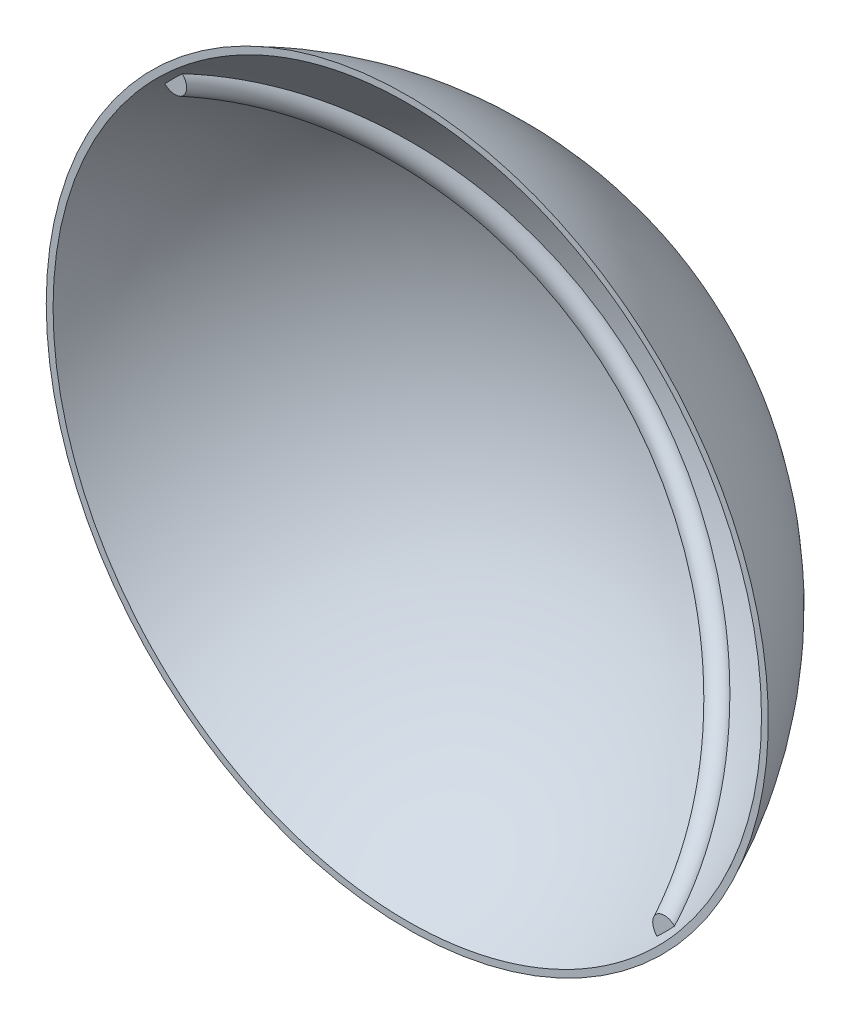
ISO-10303-21;
HEADER;
FILE_DESCRIPTION(('STEP AP214'),'2;1');
FILE_NAME('part.step','',(''),(''),'','','');
FILE_SCHEMA(('AUTOMOTIVE_DESIGN { 1 0 10303 214 1 1 1 1 }'));
ENDSEC;
DATA;
#1=APPLICATION_CONTEXT('core data for automotive mechanical design processes');
#2=APPLICATION_PROTOCOL_DEFINITION('international standard','automotive_design',2000,#1);
#3=PRODUCT_CONTEXT('',#1,'mechanical');
#4=PRODUCT('Part','Part','',(#3));
#5=PRODUCT_RELATED_PRODUCT_CATEGORY('part','',(#4));
#6=PRODUCT_DEFINITION_FORMATION('','',#4);
#7=PRODUCT_DEFINITION_CONTEXT('part definition',#1,'design');
#8=PRODUCT_DEFINITION('design','',#6,#7);
#9=PRODUCT_DEFINITION_SHAPE('','',#8);
#10=(LENGTH_UNIT() NAMED_UNIT(*) SI_UNIT(.MILLI.,.METRE.));
#11=(NAMED_UNIT(*) PLANE_ANGLE_UNIT() SI_UNIT($,.RADIAN.));
#12=(NAMED_UNIT(*) SI_UNIT($,.STERADIAN.) SOLID_ANGLE_UNIT());
#13=UNCERTAINTY_MEASURE_WITH_UNIT(LENGTH_MEASURE(1.E-05),#10,'distance_accuracy_value','');
#14=(GEOMETRIC_REPRESENTATION_CONTEXT(3) GLOBAL_UNCERTAINTY_ASSIGNED_CONTEXT((#13)) GLOBAL_UNIT_ASSIGNED_CONTEXT((#10,
#11,#12)) REPRESENTATION_CONTEXT('',''));
#15=CARTESIAN_POINT('',(0.,0.,0.));
#16=DIRECTION('',(0.,0.,1.));
#17=DIRECTION('',(1.,0.,0.));
#18=AXIS2_PLACEMENT_3D('',#15,#16,#17);
#19=CARTESIAN_POINT('',(0.,0.,0.));
#20=DIRECTION('',(-0.707106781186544,-0.707106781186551,0.));
#21=DIRECTION('',(0.707106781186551,-0.707106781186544,0.));
#22=AXIS2_PLACEMENT_3D('',#19,#20,#21);
#23=TOROIDAL_SURFACE('',#22,100.0125,3.17500000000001);
#24=CARTESIAN_POINT('',(-64.8018106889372,60.3952095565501,-45.2083884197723));
#25=CARTESIAN_POINT('',(-64.6273983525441,60.2725611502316,-45.2083884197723));
#26=CARTESIAN_POINT('',(-64.4429480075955,60.1639074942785,-45.2083884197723));
#27=CARTESIAN_POINT('',(-64.0584606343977,59.9783843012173,-45.2083884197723));
#28=CARTESIAN_POINT('',(-63.8584044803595,59.9015545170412,-45.2083884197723));
#29=CARTESIAN_POINT('',(-63.4469996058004,59.7833561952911,-45.2083884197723));
#30=CARTESIAN_POINT('',(-63.235612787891,59.7421164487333,-45.2083884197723));
#31=CARTESIAN_POINT('',(-62.9157872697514,59.7099601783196,-45.2083884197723));
#32=CARTESIAN_POINT('',(-62.8086820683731,59.7041952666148,-45.2083884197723));
#33=CARTESIAN_POINT('',(-62.5944311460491,59.7029396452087,-45.2083884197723));
#34=CARTESIAN_POINT('',(-62.4872854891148,59.7074427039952,-45.2083884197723));
#35=CARTESIAN_POINT('',(-62.2830743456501,59.7262073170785,-45.2083884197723));
#36=CARTESIAN_POINT('',(-62.1859286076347,59.7396037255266,-45.2083884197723));
#37=CARTESIAN_POINT('',(-61.9933594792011,59.7754165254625,-45.2083884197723));
#38=CARTESIAN_POINT('',(-61.8979351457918,59.797827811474,-45.2083884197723));
#39=CARTESIAN_POINT('',(-61.7097240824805,59.8517352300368,-45.2083884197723));
#40=CARTESIAN_POINT('',(-61.6169360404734,59.8832267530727,-45.2083884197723));
#41=CARTESIAN_POINT('',(-61.434958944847,59.9552121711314,-45.2083884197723));
#42=CARTESIAN_POINT('',(-61.3457694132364,59.9957048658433,-45.2083884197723));
#43=CARTESIAN_POINT('',(-61.1059978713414,60.1196287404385,-45.2083884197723));
#44=CARTESIAN_POINT('',(-60.9600740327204,60.2123544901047,-45.2083884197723));
#45=CARTESIAN_POINT('',(-60.6876847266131,60.4227838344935,-45.2083884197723));
#46=CARTESIAN_POINT('',(-60.5612090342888,60.5404742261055,-45.2083884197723));
#47=CARTESIAN_POINT('',(-60.340387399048,60.7874948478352,-45.2083884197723));
#48=CARTESIAN_POINT('',(-60.2443599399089,60.9153268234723,-45.2083884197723));
#49=CARTESIAN_POINT('',(-60.0749894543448,61.1851855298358,-45.2083884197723));
#50=CARTESIAN_POINT('',(-60.0016456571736,61.3272117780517,-45.2083884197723));
#51=CARTESIAN_POINT('',(-59.8783777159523,61.6223685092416,-45.2083884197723));
#52=CARTESIAN_POINT('',(-59.8286453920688,61.7755786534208,-45.2083884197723));
#53=CARTESIAN_POINT('',(-59.7536176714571,62.087836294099,-45.2083884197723));
#54=CARTESIAN_POINT('',(-59.7283287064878,62.2468853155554,-45.2083884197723));
#55=CARTESIAN_POINT('',(-59.700515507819,62.5792119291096,-45.2083884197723));
#56=CARTESIAN_POINT('',(-59.6998841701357,62.7526459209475,-45.2083884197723));
#57=CARTESIAN_POINT('',(-59.7246994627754,63.0976103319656,-45.2083884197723));
#58=CARTESIAN_POINT('',(-59.750156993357,63.2691399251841,-45.2083884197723));
#59=CARTESIAN_POINT('',(-59.8294850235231,63.6254774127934,-45.2083884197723));
#60=CARTESIAN_POINT('',(-59.8861872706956,63.8096549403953,-45.2083884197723));
#61=CARTESIAN_POINT('',(-60.0268022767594,64.1673014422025,-45.2083884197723));
#62=CARTESIAN_POINT('',(-60.1107274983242,64.3407654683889,-45.2083884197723));
#63=CARTESIAN_POINT('',(-60.3129973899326,64.6906502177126,-45.2083884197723));
#64=CARTESIAN_POINT('',(-60.4339931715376,64.8655423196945,-45.2083884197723));
#65=CARTESIAN_POINT('',(-60.7022079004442,65.1939483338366,-45.2083884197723));
#66=CARTESIAN_POINT('',(-60.849436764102,65.3474541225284,-45.2083884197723));
#67=CARTESIAN_POINT('',(-61.1750169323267,65.6367320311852,-45.2083884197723));
#68=CARTESIAN_POINT('',(-61.3546164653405,65.7711057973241,-45.2083884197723));
#69=CARTESIAN_POINT('',(-61.7341974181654,66.0071546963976,-45.2083884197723));
#70=CARTESIAN_POINT('',(-61.9341803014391,66.1088274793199,-45.2083884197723));
#71=CARTESIAN_POINT('',(-62.3450391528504,66.2732049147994,-45.2083884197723));
#72=CARTESIAN_POINT('',(-62.5556047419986,66.3366711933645,-45.2083884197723));
#73=CARTESIAN_POINT('',(-62.8772956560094,66.4019340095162,-45.2083884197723));
#74=CARTESIAN_POINT('',(-62.9855494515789,66.4186996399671,-45.2083884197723));
#75=CARTESIAN_POINT('',(-63.203143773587,66.4418140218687,-45.2083884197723));
#76=CARTESIAN_POINT('',(-63.3124836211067,66.4481689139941,-45.2083884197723));
#77=CARTESIAN_POINT('',(-63.5217156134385,66.449985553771,-45.2083884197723));
#78=CARTESIAN_POINT('',(-63.6216008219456,66.4463482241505,-45.2083884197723));
#79=CARTESIAN_POINT('',(-63.8205603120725,66.4298405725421,-45.2083884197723));
#80=CARTESIAN_POINT('',(-63.9196350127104,66.4169753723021,-45.2083884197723));
#81=CARTESIAN_POINT('',(-64.1160807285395,66.3818683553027,-45.2083884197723));
#82=CARTESIAN_POINT('',(-64.2134524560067,66.3596305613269,-45.2083884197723));
#83=CARTESIAN_POINT('',(-64.4055265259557,66.3057660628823,-45.2083884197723));
#84=CARTESIAN_POINT('',(-64.5002291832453,66.2741404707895,-45.2083884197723));
#85=CARTESIAN_POINT('',(-64.758278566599,66.1732968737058,-45.2083884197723));
#86=CARTESIAN_POINT('',(-64.9178180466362,66.0939582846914,-45.2083884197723));
#87=CARTESIAN_POINT('',(-65.2195690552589,65.9074769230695,-45.2083884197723));
#88=CARTESIAN_POINT('',(-65.3617904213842,65.8003500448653,-45.2083884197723));
#89=CARTESIAN_POINT('',(-65.6136983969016,65.570904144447,-45.2083884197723));
#90=CARTESIAN_POINT('',(-65.7250550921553,65.4504146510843,-45.2083884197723));
#91=CARTESIAN_POINT('',(-65.9255819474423,65.1922420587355,-45.2083884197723));
#92=CARTESIAN_POINT('',(-66.0147551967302,65.0545613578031,-45.2083884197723));
#93=CARTESIAN_POINT('',(-66.1678206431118,64.7681361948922,-45.2083884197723));
#94=CARTESIAN_POINT('',(-66.2320239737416,64.619557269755,-45.2083884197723));
#95=CARTESIAN_POINT('',(-66.3358671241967,64.3140808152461,-45.2083884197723));
#96=CARTESIAN_POINT('',(-66.3755028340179,64.1571818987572,-45.2083884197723));
#97=CARTESIAN_POINT('',(-66.431606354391,63.8312663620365,-45.2083884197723));
#98=CARTESIAN_POINT('',(-66.4468207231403,63.6620355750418,-45.2083884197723));
#99=CARTESIAN_POINT('',(-66.4511331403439,63.3232792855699,-45.2083884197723));
#100=CARTESIAN_POINT('',(-66.4402235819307,63.1537537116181,-45.2083884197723));
#101=CARTESIAN_POINT('',(-66.3916532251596,62.8028580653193,-45.2083884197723));
#102=CARTESIAN_POINT('',(-66.3516490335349,62.6218135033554,-45.2083884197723));
#103=CARTESIAN_POINT('',(-66.2446641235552,62.2678454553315,-45.2083884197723));
#104=CARTESIAN_POINT('',(-66.1776651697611,62.0949275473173,-45.2083884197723));
#105=CARTESIAN_POINT('',(-66.0110977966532,61.7435431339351,-45.2083884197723));
#106=CARTESIAN_POINT('',(-65.9088938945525,61.5663262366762,-45.2083884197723));
#107=CARTESIAN_POINT('',(-65.6783042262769,61.2300406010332,-45.2083884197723));
#108=CARTESIAN_POINT('',(-65.5499384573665,61.0709581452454,-45.2083884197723));
#109=CARTESIAN_POINT('',(-65.3180797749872,60.8247839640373,-45.2083884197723));
#110=CARTESIAN_POINT('',(-65.2209617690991,60.7316010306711,-45.2083884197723));
#111=CARTESIAN_POINT('',(-65.0178308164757,60.5554924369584,-45.2083884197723));
#112=CARTESIAN_POINT('',(-64.9118174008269,60.472567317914,-45.2083884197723));
#113=CARTESIAN_POINT('',(-64.8018106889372,60.3952095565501,-45.2083884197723));
#114=B_SPLINE_CURVE_WITH_KNOTS('',3,(#24,#25,#26,#27,#28,#29,#30,#31,#32,#33,#34,#35,#36,#37,
#38,#39,#40,#41,#42,#43,#44,#45,#46,#47,#48,#49,#50,#51,#52,#53,#54,#55,#56,#57,#58,#59,#60,#61,
#62,#63,#64,#65,#66,#67,#68,#69,#70,#71,#72,#73,#74,#75,#76,#77,#78,#79,#80,#81,#82,#83,#84,#85,
#86,#87,#88,#89,#90,#91,#92,#93,#94,#95,#96,#97,#98,#99,#100,#101,#102,#103,#104,#105,#106,#107,
#108,#109,#110,#111,#112,#113),.UNSPECIFIED.,.T.,.F.,(4,2,2,2,2,2,2,2,2,2,2,2,2,2,2,2,2,2,2,2,2,
2,2,2,2,2,2,2,2,2,2,2,2,2,2,2,2,2,2,2,2,2,2,2,4),(0.,0.639191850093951,1.27917975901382,
1.92147402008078,2.24285318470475,2.56403735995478,2.85782508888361,3.15144666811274,
3.44491945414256,3.738353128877,4.25400494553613,4.76938472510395,5.24676073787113,
5.72412052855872,6.20529471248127,6.68659547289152,7.20477711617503,7.7231753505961,
8.29892387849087,8.87493635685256,9.51015287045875,10.1456100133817,10.8152541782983,
11.4849464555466,12.1408040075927,12.4690265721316,12.7970554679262,13.0965016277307,
13.3957817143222,13.694933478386,13.9940498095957,14.5254611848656,15.0565692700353,
15.5463711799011,16.0361048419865,16.5195241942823,17.0030243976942,17.5106275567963,
18.0183785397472,18.5723219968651,19.1266402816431,19.7378062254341,20.3485067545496,
20.7516415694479,21.1547976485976),.UNSPECIFIED.);
#115=CARTESIAN_POINT('',(-65.2869245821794,60.7973622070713,-45.2083884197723));
#116=VERTEX_POINT('',#115);
#117=CARTESIAN_POINT('',(-60.7973622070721,65.2869245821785,-45.2083884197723));
#118=VERTEX_POINT('',#117);
#119=EDGE_CURVE('E71',#116,#118,#114,.T.);
#120=ORIENTED_EDGE('',*,*,#119,.F.);
#121=CARTESIAN_POINT('',(-2.24478118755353,-2.24478118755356,0.));
#122=DIRECTION('',(-0.707106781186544,-0.707106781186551,0.));
#123=DIRECTION('',(0.707106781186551,-0.707106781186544,0.));
#124=AXIS2_PLACEMENT_3D('',#121,#122,#123);
#125=CIRCLE('',#124,99.9621031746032);
#126=CARTESIAN_POINT('',(60.7973622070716,-65.2869245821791,-45.2083884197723));
#127=VERTEX_POINT('',#126);
#128=EDGE_CURVE('E54',#116,#127,#125,.T.);
#129=ORIENTED_EDGE('',*,*,#128,.T.);
#130=CARTESIAN_POINT('',(60.3788202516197,-64.7783258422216,-45.2083884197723));
#131=CARTESIAN_POINT('',(60.5055773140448,-64.9613567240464,-45.2083884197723));
#132=CARTESIAN_POINT('',(60.6479067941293,-65.1338653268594,-45.2083884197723));
#133=CARTESIAN_POINT('',(60.959506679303,-65.4530077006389,-45.2083884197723));
#134=CARTESIAN_POINT('',(61.1288266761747,-65.5995927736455,-45.2083884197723));
#135=CARTESIAN_POINT('',(61.4899512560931,-65.8621906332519,-45.2083884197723));
#136=CARTESIAN_POINT('',(61.6817719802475,-65.9781812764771,-45.2083884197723));
#137=CARTESIAN_POINT('',(62.0828794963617,-66.1748467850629,-45.2083884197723));
#138=CARTESIAN_POINT('',(62.2921571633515,-66.2555399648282,-45.2083884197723));
#139=CARTESIAN_POINT('',(62.6100676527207,-66.3455180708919,-45.2083884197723));
#140=CARTESIAN_POINT('',(62.7145496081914,-66.3701267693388,-45.2083884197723));
#141=CARTESIAN_POINT('',(62.9253052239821,-66.4097107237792,-45.2083884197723));
#142=CARTESIAN_POINT('',(63.0315779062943,-66.4246910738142,-45.2083884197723));
#143=CARTESIAN_POINT('',(63.245070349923,-66.4445955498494,-45.2083884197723));
#144=CARTESIAN_POINT('',(63.3522901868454,-66.449518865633,-45.2083884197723));
#145=CARTESIAN_POINT('',(63.5666536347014,-66.4489446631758,-45.2083884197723));
#146=CARTESIAN_POINT('',(63.673797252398,-66.4434534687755,-45.2083884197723));
#147=CARTESIAN_POINT('',(63.8763899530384,-66.4228665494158,-45.2083884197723));
#148=CARTESIAN_POINT('',(63.9719421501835,-66.4087805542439,-45.2083884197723));
#149=CARTESIAN_POINT('',(64.1612898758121,-66.3718403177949,-45.2083884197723));
#150=CARTESIAN_POINT('',(64.2550863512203,-66.3489909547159,-45.2083884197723));
#151=CARTESIAN_POINT('',(64.4400639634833,-66.294508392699,-45.2083884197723));
#152=CARTESIAN_POINT('',(64.5312461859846,-66.2628789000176,-45.2083884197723));
#153=CARTESIAN_POINT('',(64.7100921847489,-66.1909585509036,-45.2083884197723));
#154=CARTESIAN_POINT('',(64.7977563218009,-66.1506685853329,-45.2083884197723));
#155=CARTESIAN_POINT('',(65.035899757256,-66.0265794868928,-45.2083884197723));
#156=CARTESIAN_POINT('',(65.1816643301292,-65.933454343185,-45.2083884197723));
#157=CARTESIAN_POINT('',(65.4539950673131,-65.7226090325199,-45.2083884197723));
#158=CARTESIAN_POINT('',(65.5805696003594,-65.6048996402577,-45.2083884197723));
#159=CARTESIAN_POINT('',(65.8034662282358,-65.3564304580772,-45.2083884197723));
#160=CARTESIAN_POINT('',(65.9011585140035,-65.2268969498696,-45.2083884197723));
#161=CARTESIAN_POINT('',(66.0735221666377,-64.9533626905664,-45.2083884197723));
#162=CARTESIAN_POINT('',(66.1481944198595,-64.809362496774,-45.2083884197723));
#163=CARTESIAN_POINT('',(66.2735359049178,-64.5102030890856,-45.2083884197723));
#164=CARTESIAN_POINT('',(66.3240443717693,-64.3549768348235,-45.2083884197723));
#165=CARTESIAN_POINT('',(66.3999937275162,-64.0385399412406,-45.2083884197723));
#166=CARTESIAN_POINT('',(66.4254290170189,-63.8773279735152,-45.2083884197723));
#167=CARTESIAN_POINT('',(66.4525825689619,-63.5424929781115,-45.2083884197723));
#168=CARTESIAN_POINT('',(66.452668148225,-63.3687392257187,-45.2083884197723));
#169=CARTESIAN_POINT('',(66.4263861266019,-63.0232724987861,-45.2083884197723));
#170=CARTESIAN_POINT('',(66.4000086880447,-62.8515603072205,-45.2083884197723));
#171=CARTESIAN_POINT('',(66.3188271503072,-62.4972978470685,-45.2083884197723));
#172=CARTESIAN_POINT('',(66.2614987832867,-62.3153265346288,-45.2083884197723));
#173=CARTESIAN_POINT('',(66.1198617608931,-61.9622222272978,-45.2083884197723));
#174=CARTESIAN_POINT('',(66.0355415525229,-61.791093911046,-45.2083884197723));
#175=CARTESIAN_POINT('',(65.8331767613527,-61.4468537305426,-45.2083884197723));
#176=CARTESIAN_POINT('',(65.7126250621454,-61.2752130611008,-45.2083884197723));
#177=CARTESIAN_POINT('',(65.446028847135,-60.9529994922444,-45.2083884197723));
#178=CARTESIAN_POINT('',(65.2999743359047,-60.8024348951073,-45.2083884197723));
#179=CARTESIAN_POINT('',(64.9761934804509,-60.5172512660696,-45.2083884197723));
#180=CARTESIAN_POINT('',(64.7970525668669,-60.384231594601,-45.2083884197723));
#181=CARTESIAN_POINT('',(64.4188935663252,-60.1502326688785,-45.2083884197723));
#182=CARTESIAN_POINT('',(64.2198716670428,-60.0492595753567,-45.2083884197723));
#183=CARTESIAN_POINT('',(63.8081530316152,-59.884024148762,-45.2083884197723));
#184=CARTESIAN_POINT('',(63.5955388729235,-59.819559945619,-45.2083884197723));
#185=CARTESIAN_POINT('',(63.2706747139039,-59.7529050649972,-45.2083884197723));
#186=CARTESIAN_POINT('',(63.1613409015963,-59.7356926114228,-45.2083884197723));
#187=CARTESIAN_POINT('',(62.941551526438,-59.7117496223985,-45.2083884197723));
#188=CARTESIAN_POINT('',(62.831096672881,-59.7050128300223,-45.2083884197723));
#189=CARTESIAN_POINT('',(62.6191420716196,-59.7025593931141,-45.2083884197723));
#190=CARTESIAN_POINT('',(62.5176515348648,-59.7059834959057,-45.2083884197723));
#191=CARTESIAN_POINT('',(62.3154774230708,-59.7223011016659,-45.2083884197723));
#192=CARTESIAN_POINT('',(62.2147934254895,-59.7351892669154,-45.2083884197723));
#193=CARTESIAN_POINT('',(62.0151881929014,-59.7706189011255,-45.2083884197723));
#194=CARTESIAN_POINT('',(61.916266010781,-59.793155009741,-45.2083884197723));
#195=CARTESIAN_POINT('',(61.7211565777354,-59.8479655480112,-45.2083884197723));
#196=CARTESIAN_POINT('',(61.6249689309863,-59.8802385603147,-45.2083884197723));
#197=CARTESIAN_POINT('',(61.4479487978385,-59.94991605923,-45.2083884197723));
#198=CARTESIAN_POINT('',(61.3666776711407,-59.9862093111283,-45.2083884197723));
#199=CARTESIAN_POINT('',(61.2078124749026,-60.0660978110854,-45.2083884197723));
#200=CARTESIAN_POINT('',(61.1302179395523,-60.1096921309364,-45.2083884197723));
#201=CARTESIAN_POINT('',(60.9794689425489,-60.2039112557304,-45.2083884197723));
#202=CARTESIAN_POINT('',(60.9063121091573,-60.2545322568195,-45.2083884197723));
#203=CARTESIAN_POINT('',(60.7651130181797,-60.362422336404,-45.2083884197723));
#204=CARTESIAN_POINT('',(60.6970704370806,-60.4196909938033,-45.2083884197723));
#205=CARTESIAN_POINT('',(60.5136086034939,-60.5896652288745,-45.2083884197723));
#206=CARTESIAN_POINT('',(60.4046991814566,-60.7095566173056,-45.2083884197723));
#207=CARTESIAN_POINT('',(60.2090374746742,-60.9660837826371,-45.2083884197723));
#208=CARTESIAN_POINT('',(60.1222822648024,-61.102717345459,-45.2083884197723));
#209=CARTESIAN_POINT('',(59.9738028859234,-61.3864783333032,-45.2083884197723));
#210=CARTESIAN_POINT('',(59.9117435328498,-61.5334309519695,-45.2083884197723));
#211=CARTESIAN_POINT('',(59.8116283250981,-61.835248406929,-45.2083884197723));
#212=CARTESIAN_POINT('',(59.7735759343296,-61.9901143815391,-45.2083884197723));
#213=CARTESIAN_POINT('',(59.7196283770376,-62.3133615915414,-45.2083884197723));
#214=CARTESIAN_POINT('',(59.7052291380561,-62.4819904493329,-45.2083884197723));
#215=CARTESIAN_POINT('',(59.7020779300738,-62.8195078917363,-45.2083884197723));
#216=CARTESIAN_POINT('',(59.7133429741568,-62.9883965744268,-45.2083884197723));
#217=CARTESIAN_POINT('',(59.7624413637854,-63.3405134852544,-45.2083884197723));
#218=CARTESIAN_POINT('',(59.8029643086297,-63.5233641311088,-45.2083884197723));
#219=CARTESIAN_POINT('',(59.9110370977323,-63.8807082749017,-45.2083884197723));
#220=CARTESIAN_POINT('',(59.9785657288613,-64.0552082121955,-45.2083884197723));
#221=CARTESIAN_POINT('',(60.1039939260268,-64.3204344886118,-45.2083884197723));
#222=CARTESIAN_POINT('',(60.1537024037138,-64.4151289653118,-45.2083884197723));
#223=CARTESIAN_POINT('',(60.2606839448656,-64.6001328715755,-45.2083884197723));
#224=CARTESIAN_POINT('',(60.3179569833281,-64.6904423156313,-45.2083884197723));
#225=CARTESIAN_POINT('',(60.3788202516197,-64.7783258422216,-45.2083884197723));
#226=B_SPLINE_CURVE_WITH_KNOTS('',3,(#130,#131,#132,#133,#134,#135,#136,#137,#138,#139,#140,
#141,#142,#143,#144,#145,#146,#147,#148,#149,#150,#151,#152,#153,#154,#155,#156,#157,#158,#159,
#160,#161,#162,#163,#164,#165,#166,#167,#168,#169,#170,#171,#172,#173,#174,#175,#176,#177,#178,
#179,#180,#181,#182,#183,#184,#185,#186,#187,#188,#189,#190,#191,#192,#193,#194,#195,#196,#197,
#198,#199,#200,#201,#202,#203,#204,#205,#206,#207,#208,#209,#210,#211,#212,#213,#214,#215,#216,
#217,#218,#219,#220,#221,#222,#223,#224,#225),.UNSPECIFIED.,.T.,.F.,(4,2,2,2,2,2,2,2,2,2,2,2,2,
2,2,2,2,2,2,2,2,2,2,2,2,2,2,2,2,2,2,2,2,2,2,2,2,2,2,2,2,2,2,2,2,2,2,4),(0.,0.667526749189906,
1.33629444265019,2.00554485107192,2.67444759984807,2.99610779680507,3.31759767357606,
3.63911344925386,3.9604340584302,4.24979183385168,4.53898876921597,4.82806381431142,
5.11710913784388,5.63306969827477,6.14880459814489,6.63322640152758,7.1176295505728,
7.60521216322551,8.09290363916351,8.61199914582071,9.13128769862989,9.70128315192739,
10.271522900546,10.8980433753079,11.5248099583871,12.1910125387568,12.8573431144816,
13.5199524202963,13.851583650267,14.1830167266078,14.4872422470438,14.7912963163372,
15.0951816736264,15.3990228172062,15.6656822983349,15.9323079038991,16.1987897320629,
16.4652546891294,16.9485788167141,17.4318390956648,17.9082962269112,18.3848220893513,
18.8904648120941,19.3964428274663,19.956053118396,20.5152246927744,20.8357432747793,
21.1562607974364),.UNSPECIFIED.);
#227=CARTESIAN_POINT('',(65.2869245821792,-60.7973622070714,-45.2083884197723));
#228=VERTEX_POINT('',#227);
#229=EDGE_CURVE('E63',#228,#127,#226,.T.);
#230=ORIENTED_EDGE('',*,*,#229,.F.);
#231=CARTESIAN_POINT('',(2.24478118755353,2.24478118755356,0.));
#232=DIRECTION('',(0.707106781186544,0.707106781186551,0.));
#233=DIRECTION('',(-0.707106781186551,0.707106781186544,0.));
#234=AXIS2_PLACEMENT_3D('',#231,#232,#233);
#235=CIRCLE('',#234,99.9621031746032);
#236=EDGE_CURVE('E85',#228,#118,#235,.T.);
#237=ORIENTED_EDGE('',*,*,#236,.T.);
#238=EDGE_LOOP('',(#120,#129,#230,#237));
#239=FACE_BOUND('',#238,.T.);
#240=ADVANCED_FACE('F46',(#239),#23,.T.);
#241=CARTESIAN_POINT('',(566.940905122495,93.9648058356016,-42.0333884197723));
#242=DIRECTION('',(0.,0.,-1.));
#243=DIRECTION('',(-1.,0.,0.));
#244=AXIS2_PLACEMENT_3D('',#241,#242,#243);
#245=PLANE('',#244);
#246=CARTESIAN_POINT('',(0.,0.,-42.0333884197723));
#247=DIRECTION('',(0.,0.,-1.));
#248=DIRECTION('',(-1.,0.,0.));
#249=AXIS2_PLACEMENT_3D('',#246,#247,#248);
#250=CIRCLE('',#249,92.4973202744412);
#251=CARTESIAN_POINT('',(-92.4973202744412,0.,-42.0333884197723));
#252=VERTEX_POINT('',#251);
#253=EDGE_CURVE('E79',#252,#252,#250,.T.);
#254=ORIENTED_EDGE('',*,*,#253,.F.);
#255=EDGE_LOOP('',(#254));
#256=FACE_BOUND('',#255,.T.);
#257=CARTESIAN_POINT('',(0.,0.,-42.0333884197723));
#258=DIRECTION('',(0.,0.,-1.));
#259=DIRECTION('',(-1.,0.,0.));
#260=AXIS2_PLACEMENT_3D('',#257,#258,#259);
#261=CIRCLE('',#260,90.7507267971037);
#262=CARTESIAN_POINT('',(-90.7507267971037,0.,-42.0333884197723));
#263=VERTEX_POINT('',#262);
#264=EDGE_CURVE('E13',#263,#263,#261,.F.);
#265=ORIENTED_EDGE('',*,*,#264,.F.);
#266=EDGE_LOOP('',(#265));
#267=FACE_BOUND('',#266,.T.);
#268=ADVANCED_FACE('F102',(#256,#267),#245,.F.);
#269=CARTESIAN_POINT('',(0.,0.,0.));
#270=DIRECTION('',(0.,1.,0.));
#271=DIRECTION('',(1.,0.,0.));
#272=AXIS2_PLACEMENT_3D('',#269,#270,#271);
#273=SPHERICAL_SURFACE('',#272,100.0125);
#274=CARTESIAN_POINT('',(0.,0.,-45.2083884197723));
#275=DIRECTION('',(0.,0.,1.));
#276=DIRECTION('',(1.,0.,0.));
#277=AXIS2_PLACEMENT_3D('',#274,#275,#276);
#278=CIRCLE('',#277,89.2115562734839);
#279=EDGE_CURVE('E60',#127,#228,#278,.T.);
#280=ORIENTED_EDGE('',*,*,#279,.F.);
#281=ORIENTED_EDGE('',*,*,#128,.F.);
#282=EDGE_CURVE('E74',#118,#116,#278,.T.);
#283=ORIENTED_EDGE('',*,*,#282,.F.);
#284=ORIENTED_EDGE('',*,*,#236,.F.);
#285=EDGE_LOOP('',(#280,#281,#283,#284));
#286=FACE_BOUND('',#285,.T.);
#287=ORIENTED_EDGE('',*,*,#264,.T.);
#288=EDGE_LOOP('',(#287));
#289=FACE_BOUND('',#288,.T.);
#290=ADVANCED_FACE('F83',(#286,#289),#273,.F.);
#291=CARTESIAN_POINT('',(0.,0.,0.));
#292=DIRECTION('',(0.,1.,0.));
#293=DIRECTION('',(-1.,0.,0.));
#294=AXIS2_PLACEMENT_3D('',#291,#292,#293);
#295=SPHERICAL_SURFACE('',#294,101.6);
#296=CARTESIAN_POINT('',(0.,0.,0.));
#297=DIRECTION('',(0.,0.,-1.));
#298=DIRECTION('',(-1.,0.,0.));
#299=AXIS2_PLACEMENT_3D('',#296,#297,#298);
#300=SPHERICAL_SURFACE('',#299,101.6);
#301=ORIENTED_EDGE('',*,*,#253,.T.);
#302=EDGE_LOOP('',(#301));
#303=FACE_BOUND('',#302,.T.);
#304=ADVANCED_FACE('F48',(#303),#300,.T.);
#305=CARTESIAN_POINT('',(-81.7550355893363,0.,-45.2083884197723));
#306=DIRECTION('',(0.,0.,1.));
#307=DIRECTION('',(1.,0.,0.));
#308=AXIS2_PLACEMENT_3D('',#305,#306,#307);
#309=PLANE('',#308);
#310=ORIENTED_EDGE('',*,*,#119,.T.);
#311=ORIENTED_EDGE('',*,*,#282,.T.);
#312=EDGE_LOOP('',(#310,#311));
#313=FACE_BOUND('',#312,.T.);
#314=ADVANCED_FACE('F73',(#313),#309,.T.);
#315=ORIENTED_EDGE('',*,*,#229,.T.);
#316=ORIENTED_EDGE('',*,*,#279,.T.);
#317=EDGE_LOOP('',(#315,#316));
#318=FACE_BOUND('',#317,.T.);
#319=ADVANCED_FACE('F101',(#318),#309,.T.);
#320=CLOSED_SHELL('',(#240,#268,#290,#304,#314,#319));
#321=MANIFOLD_SOLID_BREP('B2',#320);
#322=ADVANCED_BREP_SHAPE_REPRESENTATION('',(#18,#321),#14);
#323=SHAPE_DEFINITION_REPRESENTATION(#9,#322);
ENDSEC;
END-ISO-10303-21;
